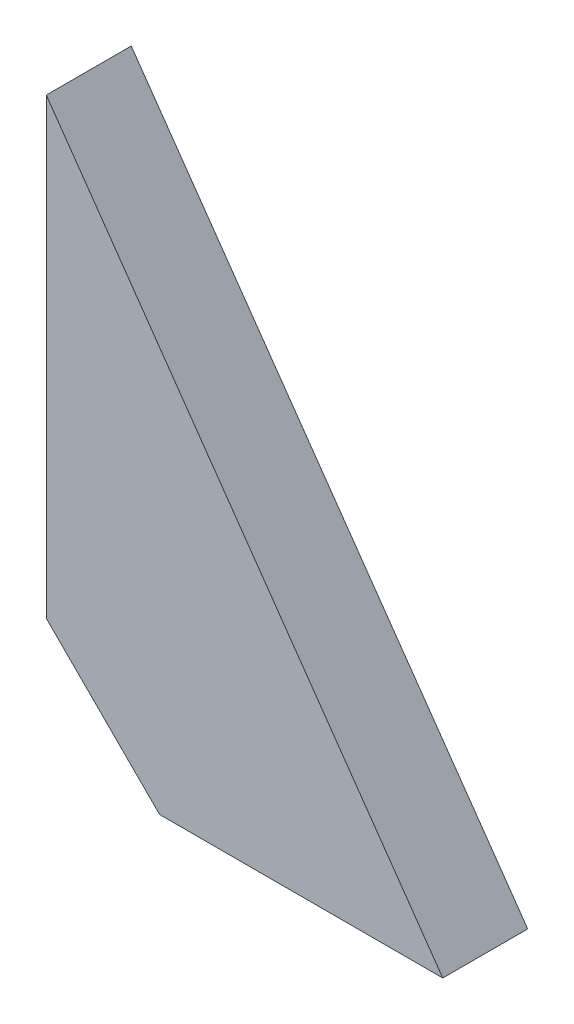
ISO-10303-21;
HEADER;
FILE_DESCRIPTION(('STEP AP214'),'2;1');
FILE_NAME('part.step','',(''),(''),'','','');
FILE_SCHEMA(('AUTOMOTIVE_DESIGN { 1 0 10303 214 1 1 1 1 }'));
ENDSEC;
DATA;
#1=APPLICATION_CONTEXT('core data for automotive mechanical design processes');
#2=APPLICATION_PROTOCOL_DEFINITION('international standard','automotive_design',2000,#1);
#3=PRODUCT_CONTEXT('',#1,'mechanical');
#4=PRODUCT('Part','Part','',(#3));
#5=PRODUCT_RELATED_PRODUCT_CATEGORY('part','',(#4));
#6=PRODUCT_DEFINITION_FORMATION('','',#4);
#7=PRODUCT_DEFINITION_CONTEXT('part definition',#1,'design');
#8=PRODUCT_DEFINITION('design','',#6,#7);
#9=PRODUCT_DEFINITION_SHAPE('','',#8);
#10=(LENGTH_UNIT() NAMED_UNIT(*) SI_UNIT(.MILLI.,.METRE.));
#11=(NAMED_UNIT(*) PLANE_ANGLE_UNIT() SI_UNIT($,.RADIAN.));
#12=(NAMED_UNIT(*) SI_UNIT($,.STERADIAN.) SOLID_ANGLE_UNIT());
#13=UNCERTAINTY_MEASURE_WITH_UNIT(LENGTH_MEASURE(1.E-05),#10,'distance_accuracy_value','');
#14=(GEOMETRIC_REPRESENTATION_CONTEXT(3) GLOBAL_UNCERTAINTY_ASSIGNED_CONTEXT((#13)) GLOBAL_UNIT_ASSIGNED_CONTEXT((#10,
#11,#12)) REPRESENTATION_CONTEXT('',''));
#15=CARTESIAN_POINT('',(0.,0.,0.));
#16=DIRECTION('',(0.,0.,1.));
#17=DIRECTION('',(1.,0.,0.));
#18=AXIS2_PLACEMENT_3D('',#15,#16,#17);
#19=CARTESIAN_POINT('',(14.,0.,3.));
#20=DIRECTION('',(-0.81923192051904,-0.573462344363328,0.));
#21=DIRECTION('',(0.573462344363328,-0.819231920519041,0.));
#22=AXIS2_PLACEMENT_3D('',#19,#20,#21);
#23=PLANE('',#22);
#24=DIRECTION('',(-0.573462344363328,0.819231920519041,0.));
#25=VECTOR('',#24,1.);
#26=CARTESIAN_POINT('',(14.,0.,0.));
#27=LINE('',#26,#25);
#28=CARTESIAN_POINT('',(14.,0.,0.));
#29=VERTEX_POINT('',#28);
#30=CARTESIAN_POINT('',(0.,20.,0.));
#31=VERTEX_POINT('',#30);
#32=EDGE_CURVE('E107',#29,#31,#27,.T.);
#33=ORIENTED_EDGE('',*,*,#32,.T.);
#34=DIRECTION('',(0.,0.,-1.));
#35=VECTOR('',#34,1.);
#36=CARTESIAN_POINT('',(0.,20.,3.));
#37=LINE('',#36,#35);
#38=CARTESIAN_POINT('',(0.,20.,3.));
#39=VERTEX_POINT('',#38);
#40=EDGE_CURVE('E11',#39,#31,#37,.T.);
#41=ORIENTED_EDGE('',*,*,#40,.F.);
#42=DIRECTION('',(-0.573462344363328,0.819231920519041,0.));
#43=VECTOR('',#42,1.);
#44=CARTESIAN_POINT('',(14.,0.,3.));
#45=LINE('',#44,#43);
#46=CARTESIAN_POINT('',(14.,0.,3.));
#47=VERTEX_POINT('',#46);
#48=EDGE_CURVE('E91',#47,#39,#45,.T.);
#49=ORIENTED_EDGE('',*,*,#48,.F.);
#50=DIRECTION('',(0.,0.,-1.));
#51=VECTOR('',#50,1.);
#52=CARTESIAN_POINT('',(14.,0.,3.));
#53=LINE('',#52,#51);
#54=EDGE_CURVE('E103',#47,#29,#53,.T.);
#55=ORIENTED_EDGE('',*,*,#54,.T.);
#56=EDGE_LOOP('',(#33,#41,#49,#55));
#57=FACE_BOUND('',#56,.T.);
#58=ADVANCED_FACE('F39',(#57),#23,.F.);
#59=CARTESIAN_POINT('',(0.,20.,3.));
#60=DIRECTION('',(1.,0.,0.));
#61=DIRECTION('',(0.,1.,0.));
#62=AXIS2_PLACEMENT_3D('',#59,#60,#61);
#63=PLANE('',#62);
#64=DIRECTION('',(0.,-1.,0.));
#65=VECTOR('',#64,1.);
#66=CARTESIAN_POINT('',(0.,20.,0.));
#67=LINE('',#66,#65);
#68=CARTESIAN_POINT('',(0.,4.00000000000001,0.));
#69=VERTEX_POINT('',#68);
#70=EDGE_CURVE('E96',#31,#69,#67,.T.);
#71=ORIENTED_EDGE('',*,*,#70,.T.);
#72=DIRECTION('',(0.,0.,-1.));
#73=VECTOR('',#72,1.);
#74=CARTESIAN_POINT('',(0.,4.00000000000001,3.));
#75=LINE('',#74,#73);
#76=CARTESIAN_POINT('',(0.,4.00000000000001,3.));
#77=VERTEX_POINT('',#76);
#78=EDGE_CURVE('E48',#77,#69,#75,.T.);
#79=ORIENTED_EDGE('',*,*,#78,.F.);
#80=DIRECTION('',(0.,-1.,0.));
#81=VECTOR('',#80,1.);
#82=CARTESIAN_POINT('',(0.,20.,3.));
#83=LINE('',#82,#81);
#84=EDGE_CURVE('E86',#39,#77,#83,.T.);
#85=ORIENTED_EDGE('',*,*,#84,.F.);
#86=ORIENTED_EDGE('',*,*,#40,.T.);
#87=EDGE_LOOP('',(#71,#79,#85,#86));
#88=FACE_BOUND('',#87,.T.);
#89=ADVANCED_FACE('F95',(#88),#63,.F.);
#90=CARTESIAN_POINT('',(0.,4.00000000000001,3.));
#91=DIRECTION('',(0.707106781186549,0.707106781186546,0.));
#92=DIRECTION('',(-0.707106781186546,0.707106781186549,0.));
#93=AXIS2_PLACEMENT_3D('',#90,#91,#92);
#94=PLANE('',#93);
#95=DIRECTION('',(0.707106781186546,-0.707106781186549,0.));
#96=VECTOR('',#95,1.);
#97=CARTESIAN_POINT('',(0.,4.00000000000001,0.));
#98=LINE('',#97,#96);
#99=CARTESIAN_POINT('',(4.,0.,0.));
#100=VERTEX_POINT('',#99);
#101=EDGE_CURVE('E73',#69,#100,#98,.T.);
#102=ORIENTED_EDGE('',*,*,#101,.T.);
#103=DIRECTION('',(0.,0.,-1.));
#104=VECTOR('',#103,1.);
#105=CARTESIAN_POINT('',(4.,0.,3.));
#106=LINE('',#105,#104);
#107=CARTESIAN_POINT('',(4.,0.,3.));
#108=VERTEX_POINT('',#107);
#109=EDGE_CURVE('E98',#108,#100,#106,.T.);
#110=ORIENTED_EDGE('',*,*,#109,.F.);
#111=DIRECTION('',(0.707106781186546,-0.707106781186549,0.));
#112=VECTOR('',#111,1.);
#113=CARTESIAN_POINT('',(0.,4.00000000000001,3.));
#114=LINE('',#113,#112);
#115=EDGE_CURVE('E89',#77,#108,#114,.T.);
#116=ORIENTED_EDGE('',*,*,#115,.F.);
#117=ORIENTED_EDGE('',*,*,#78,.T.);
#118=EDGE_LOOP('',(#102,#110,#116,#117));
#119=FACE_BOUND('',#118,.T.);
#120=ADVANCED_FACE('F99',(#119),#94,.F.);
#121=CARTESIAN_POINT('',(4.,0.,3.));
#122=DIRECTION('',(0.,1.,0.));
#123=DIRECTION('',(-1.,0.,0.));
#124=AXIS2_PLACEMENT_3D('',#121,#122,#123);
#125=PLANE('',#124);
#126=DIRECTION('',(1.,0.,0.));
#127=VECTOR('',#126,1.);
#128=CARTESIAN_POINT('',(4.,0.,0.));
#129=LINE('',#128,#127);
#130=EDGE_CURVE('E79',#100,#29,#129,.T.);
#131=ORIENTED_EDGE('',*,*,#130,.T.);
#132=ORIENTED_EDGE('',*,*,#54,.F.);
#133=DIRECTION('',(1.,0.,0.));
#134=VECTOR('',#133,1.);
#135=CARTESIAN_POINT('',(4.,0.,3.));
#136=LINE('',#135,#134);
#137=EDGE_CURVE('E56',#108,#47,#136,.T.);
#138=ORIENTED_EDGE('',*,*,#137,.F.);
#139=ORIENTED_EDGE('',*,*,#109,.T.);
#140=EDGE_LOOP('',(#131,#132,#138,#139));
#141=FACE_BOUND('',#140,.T.);
#142=ADVANCED_FACE('F120',(#141),#125,.F.);
#143=CARTESIAN_POINT('',(0.,0.,3.));
#144=DIRECTION('',(0.,0.,-1.));
#145=DIRECTION('',(-1.,0.,0.));
#146=AXIS2_PLACEMENT_3D('',#143,#144,#145);
#147=PLANE('',#146);
#148=ORIENTED_EDGE('',*,*,#48,.T.);
#149=ORIENTED_EDGE('',*,*,#84,.T.);
#150=ORIENTED_EDGE('',*,*,#115,.T.);
#151=ORIENTED_EDGE('',*,*,#137,.T.);
#152=EDGE_LOOP('',(#148,#149,#150,#151));
#153=FACE_BOUND('',#152,.T.);
#154=ADVANCED_FACE('F87',(#153),#147,.F.);
#155=CARTESIAN_POINT('',(0.,0.,0.));
#156=DIRECTION('',(0.,0.,-1.));
#157=DIRECTION('',(-1.,0.,0.));
#158=AXIS2_PLACEMENT_3D('',#155,#156,#157);
#159=PLANE('',#158);
#160=ORIENTED_EDGE('',*,*,#32,.F.);
#161=ORIENTED_EDGE('',*,*,#130,.F.);
#162=ORIENTED_EDGE('',*,*,#101,.F.);
#163=ORIENTED_EDGE('',*,*,#70,.F.);
#164=EDGE_LOOP('',(#160,#161,#162,#163));
#165=FACE_BOUND('',#164,.T.);
#166=ADVANCED_FACE('F123',(#165),#159,.T.);
#167=CLOSED_SHELL('',(#58,#89,#120,#142,#154,#166));
#168=MANIFOLD_SOLID_BREP('B2',#167);
#169=ADVANCED_BREP_SHAPE_REPRESENTATION('',(#18,#168),#14);
#170=SHAPE_DEFINITION_REPRESENTATION(#9,#169);
ENDSEC;
END-ISO-10303-21;
